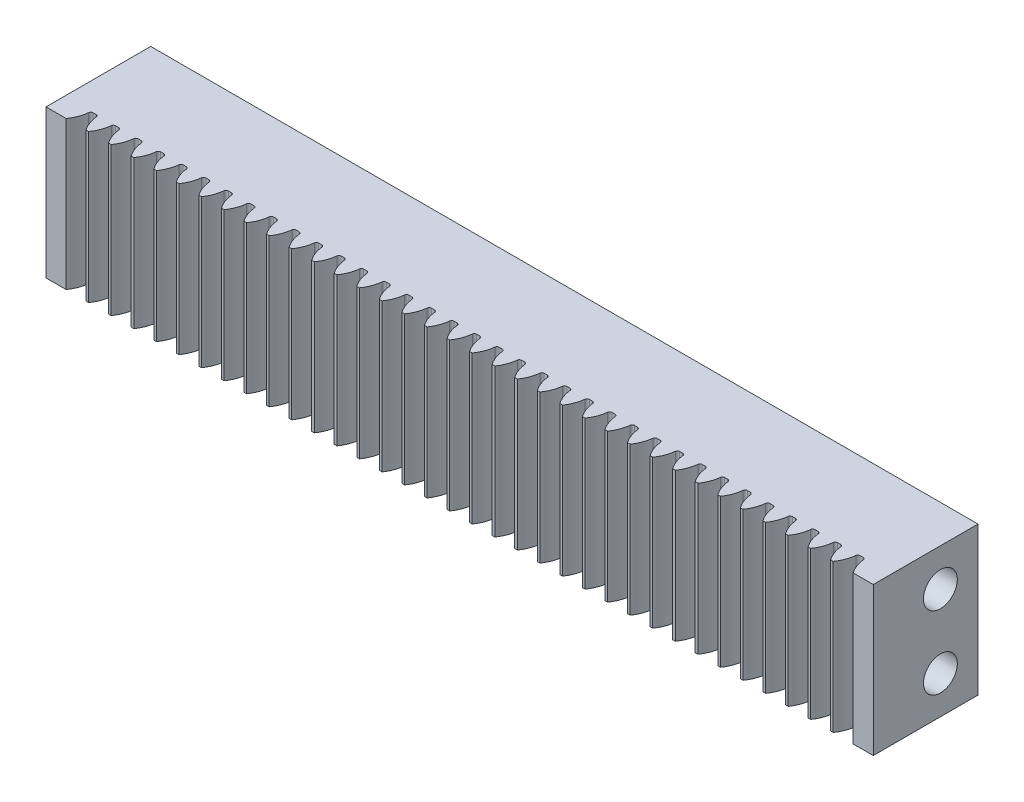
from build123d import *

# Parameters (mm, degrees)
SKIZZE8_W                       = 110
SKIZZE8_H                       = 13.925
AUFSATZ_LINEAR_AUSTRAGEN3_DEPTH = 19.7
SCHNITT_LINEAR_AUSTRAGEN1_DEPTH = 19.7
LINEARES_MUSTER1_COUNT          = 33
LINEARES_MUSTER1_PITCH          = 3
LINEARES_MUSTER2_COUNT          = 3
LINEARES_MUSTER2_PITCH          = 3
SKIZZE10_R                      = 2.25
SCHNITT_LINEAR_AUSTRAGEN2_DEPTH = 12


with BuildPart() as part:
    # Skizze8 → Aufsatz-Linear austragen3 (new body)
    with BuildSketch(Plane(origin=(0, 0, 0), x_dir=(1, 0, 0), z_dir=(0, 1, 0))):
        with Locations((55, 6.9625)):
            Rectangle(SKIZZE8_W, SKIZZE8_H)
    extrude(amount=AUFSATZ_LINEAR_AUSTRAGEN3_DEPTH)

    # Skizze9 → Schnitt-Linear austragen1 (cut)
    with BuildSketch(Plane.XZ):
        with BuildLine():
            Line((9.79791179, -2.45), (10.20208821, -2.45))
            ThreePointArc((10.20208821, -2.45), (10.402930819, -2.372850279), (10.500473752, -2.181081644))
            ThreePointArc((10.500473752, -2.181081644), (10.995230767, -0.540156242), (12.060800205, 0.802223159))
            ThreePointArc((12.060800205, 0.802223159), (10, 0.920581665), (7.939199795, 0.802223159))
            ThreePointArc((7.939199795, 0.802223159), (9.004769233, -0.540156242), (9.499526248, -2.181081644))
            ThreePointArc((9.499526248, -2.181081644), (9.597069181, -2.372850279), (9.79791179, -2.45))
        make_face()
    schnitt_linear_austragen1 = extrude(amount=-SCHNITT_LINEAR_AUSTRAGEN1_DEPTH, mode=Mode.SUBTRACT)

    # Lineares Muster1: Schnitt-Linear austragen1 ×33
    with Locations(*[(i * LINEARES_MUSTER1_PITCH, 0, 0) for i in range(1, LINEARES_MUSTER1_COUNT)]):
        add(schnitt_linear_austragen1, mode=Mode.SUBTRACT)

    # Lineares Muster2: Schnitt-Linear austragen1 ×3
    with Locations(*[(-i * LINEARES_MUSTER2_PITCH, 0, 0) for i in range(1, LINEARES_MUSTER2_COUNT)]):
        add(schnitt_linear_austragen1, mode=Mode.SUBTRACT)

    # Skizze10 → Schnitt-Linear austragen2 (cut)
    with BuildSketch(Plane(origin=(110, 0, 0), x_dir=(0, 0, -1), z_dir=(1, 0, 0))):
        with Locations((8.925, 14.7)):
            Circle(SKIZZE10_R)
        with Locations((8.925, 5)):
            Circle(SKIZZE10_R)
    extrude(amount=-SCHNITT_LINEAR_AUSTRAGEN2_DEPTH, mode=Mode.SUBTRACT)


solid = part.part
